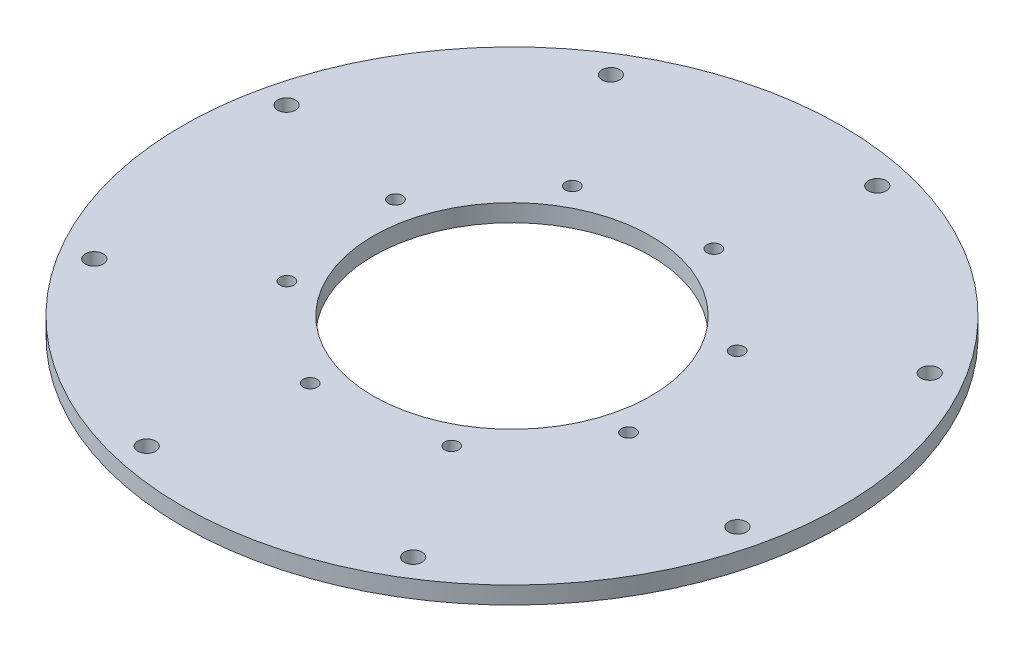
ISO-10303-21;
HEADER;
FILE_DESCRIPTION(('STEP AP214'),'2;1');
FILE_NAME('part.step','',(''),(''),'','','');
FILE_SCHEMA(('AUTOMOTIVE_DESIGN { 1 0 10303 214 1 1 1 1 }'));
ENDSEC;
DATA;
#1=APPLICATION_CONTEXT('core data for automotive mechanical design processes');
#2=APPLICATION_PROTOCOL_DEFINITION('international standard','automotive_design',2000,#1);
#3=PRODUCT_CONTEXT('',#1,'mechanical');
#4=PRODUCT('Part','Part','',(#3));
#5=PRODUCT_RELATED_PRODUCT_CATEGORY('part','',(#4));
#6=PRODUCT_DEFINITION_FORMATION('','',#4);
#7=PRODUCT_DEFINITION_CONTEXT('part definition',#1,'design');
#8=PRODUCT_DEFINITION('design','',#6,#7);
#9=PRODUCT_DEFINITION_SHAPE('','',#8);
#10=(LENGTH_UNIT() NAMED_UNIT(*) SI_UNIT(.MILLI.,.METRE.));
#11=(NAMED_UNIT(*) PLANE_ANGLE_UNIT() SI_UNIT($,.RADIAN.));
#12=(NAMED_UNIT(*) SI_UNIT($,.STERADIAN.) SOLID_ANGLE_UNIT());
#13=UNCERTAINTY_MEASURE_WITH_UNIT(LENGTH_MEASURE(1.E-05),#10,'distance_accuracy_value','');
#14=(GEOMETRIC_REPRESENTATION_CONTEXT(3) GLOBAL_UNCERTAINTY_ASSIGNED_CONTEXT((#13)) GLOBAL_UNIT_ASSIGNED_CONTEXT((#10,
#11,#12)) REPRESENTATION_CONTEXT('',''));
#15=CARTESIAN_POINT('',(0.,0.,0.));
#16=DIRECTION('',(0.,0.,1.));
#17=DIRECTION('',(1.,0.,0.));
#18=AXIS2_PLACEMENT_3D('',#15,#16,#17);
#19=CARTESIAN_POINT('',(0.,6.35,0.));
#20=DIRECTION('',(0.,-1.,0.));
#21=DIRECTION('',(0.,0.,-1.));
#22=AXIS2_PLACEMENT_3D('',#19,#20,#21);
#23=CYLINDRICAL_SURFACE('',#22,120.65);
#24=CARTESIAN_POINT('',(0.,6.35,0.));
#25=DIRECTION('',(0.,1.,0.));
#26=DIRECTION('',(0.,0.,1.));
#27=AXIS2_PLACEMENT_3D('',#24,#25,#26);
#28=CIRCLE('',#27,120.65);
#29=CARTESIAN_POINT('',(0.,6.35,120.65));
#30=VERTEX_POINT('',#29);
#31=EDGE_CURVE('E10',#30,#30,#28,.T.);
#32=ORIENTED_EDGE('',*,*,#31,.F.);
#33=EDGE_LOOP('',(#32));
#34=FACE_BOUND('',#33,.T.);
#35=CARTESIAN_POINT('',(0.,0.,0.));
#36=DIRECTION('',(0.,1.,0.));
#37=DIRECTION('',(0.,0.,1.));
#38=AXIS2_PLACEMENT_3D('',#35,#36,#37);
#39=CIRCLE('',#38,120.65);
#40=CARTESIAN_POINT('',(0.,0.,120.65));
#41=VERTEX_POINT('',#40);
#42=EDGE_CURVE('E43',#41,#41,#39,.T.);
#43=ORIENTED_EDGE('',*,*,#42,.T.);
#44=EDGE_LOOP('',(#43));
#45=FACE_BOUND('',#44,.T.);
#46=ADVANCED_FACE('F36',(#34,#45),#23,.T.);
#47=CARTESIAN_POINT('',(0.,6.35,0.));
#48=DIRECTION('',(0.,1.,0.));
#49=DIRECTION('',(0.,0.,1.));
#50=AXIS2_PLACEMENT_3D('',#47,#48,#49);
#51=PLANE('',#50);
#52=CARTESIAN_POINT('',(-52.2448042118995,6.35,30.159344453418));
#53=DIRECTION('',(0.,1.,0.));
#54=DIRECTION('',(0.,0.,1.));
#55=AXIS2_PLACEMENT_3D('',#52,#53,#54);
#56=CIRCLE('',#55,2.5527);
#57=CARTESIAN_POINT('',(-52.2448042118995,6.35,32.712044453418));
#58=VERTEX_POINT('',#57);
#59=EDGE_CURVE('E218',#58,#58,#56,.T.);
#60=ORIENTED_EDGE('',*,*,#59,.F.);
#61=EDGE_LOOP('',(#60));
#62=FACE_BOUND('',#61,.T.);
#63=CARTESIAN_POINT('',(-58.2685323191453,6.35,-15.6167783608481));
#64=DIRECTION('',(0.,1.,0.));
#65=DIRECTION('',(0.,0.,1.));
#66=AXIS2_PLACEMENT_3D('',#63,#64,#65);
#67=CIRCLE('',#66,2.5527);
#68=CARTESIAN_POINT('',(-58.2685323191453,6.35,-13.0640783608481));
#69=VERTEX_POINT('',#68);
#70=EDGE_CURVE('E228',#69,#69,#67,.T.);
#71=ORIENTED_EDGE('',*,*,#70,.F.);
#72=EDGE_LOOP('',(#71));
#73=FACE_BOUND('',#72,.T.);
#74=CARTESIAN_POINT('',(-30.1593444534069,6.35,-52.2448042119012));
#75=DIRECTION('',(0.,1.,0.));
#76=DIRECTION('',(0.,0.,1.));
#77=AXIS2_PLACEMENT_3D('',#74,#75,#76);
#78=CIRCLE('',#77,2.5527);
#79=CARTESIAN_POINT('',(-30.1593444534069,6.35,-49.6921042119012));
#80=VERTEX_POINT('',#79);
#81=EDGE_CURVE('E39',#80,#80,#78,.T.);
#82=ORIENTED_EDGE('',*,*,#81,.F.);
#83=EDGE_LOOP('',(#82));
#84=FACE_BOUND('',#83,.T.);
#85=CARTESIAN_POINT('',(15.6167783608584,6.35,-58.268532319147));
#86=DIRECTION('',(0.,1.,0.));
#87=DIRECTION('',(0.,0.,1.));
#88=AXIS2_PLACEMENT_3D('',#85,#86,#87);
#89=CIRCLE('',#88,2.5527);
#90=CARTESIAN_POINT('',(15.6167783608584,6.35,-55.715832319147));
#91=VERTEX_POINT('',#90);
#92=EDGE_CURVE('E237',#91,#91,#89,.T.);
#93=ORIENTED_EDGE('',*,*,#92,.F.);
#94=EDGE_LOOP('',(#93));
#95=FACE_BOUND('',#94,.T.);
#96=CARTESIAN_POINT('',(52.2448042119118,6.35,-30.159344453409));
#97=DIRECTION('',(0.,1.,0.));
#98=DIRECTION('',(0.,0.,1.));
#99=AXIS2_PLACEMENT_3D('',#96,#97,#98);
#100=CIRCLE('',#99,2.5527);
#101=CARTESIAN_POINT('',(52.2448042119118,6.35,-27.606644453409));
#102=VERTEX_POINT('',#101);
#103=EDGE_CURVE('E68',#102,#102,#100,.T.);
#104=ORIENTED_EDGE('',*,*,#103,.F.);
#105=EDGE_LOOP('',(#104));
#106=FACE_BOUND('',#105,.T.);
#107=CARTESIAN_POINT('',(58.2685323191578,6.35,15.616778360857));
#108=DIRECTION('',(0.,1.,0.));
#109=DIRECTION('',(0.,0.,1.));
#110=AXIS2_PLACEMENT_3D('',#107,#108,#109);
#111=CIRCLE('',#110,2.5527);
#112=CARTESIAN_POINT('',(58.2685323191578,6.35,18.169478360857));
#113=VERTEX_POINT('',#112);
#114=EDGE_CURVE('E58',#113,#113,#111,.T.);
#115=ORIENTED_EDGE('',*,*,#114,.F.);
#116=EDGE_LOOP('',(#115));
#117=FACE_BOUND('',#116,.T.);
#118=CARTESIAN_POINT('',(30.1593444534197,6.35,52.2448042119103));
#119=DIRECTION('',(0.,1.,0.));
#120=DIRECTION('',(0.,0.,1.));
#121=AXIS2_PLACEMENT_3D('',#118,#119,#120);
#122=CIRCLE('',#121,2.5527);
#123=CARTESIAN_POINT('',(30.1593444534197,6.35,54.7975042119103));
#124=VERTEX_POINT('',#123);
#125=EDGE_CURVE('E65',#124,#124,#122,.T.);
#126=ORIENTED_EDGE('',*,*,#125,.F.);
#127=EDGE_LOOP('',(#126));
#128=FACE_BOUND('',#127,.T.);
#129=CARTESIAN_POINT('',(-15.6167783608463,6.35,58.2685323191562));
#130=DIRECTION('',(0.,1.,0.));
#131=DIRECTION('',(0.,0.,1.));
#132=AXIS2_PLACEMENT_3D('',#129,#130,#131);
#133=CIRCLE('',#132,2.5527);
#134=CARTESIAN_POINT('',(-15.6167783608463,6.35,60.8212323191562));
#135=VERTEX_POINT('',#134);
#136=EDGE_CURVE('E82',#135,#135,#133,.T.);
#137=ORIENTED_EDGE('',*,*,#136,.F.);
#138=EDGE_LOOP('',(#137));
#139=FACE_BOUND('',#138,.T.);
#140=CARTESIAN_POINT('',(25.5902282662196,6.35,-108.138364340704));
#141=DIRECTION('',(0.,1.,0.));
#142=DIRECTION('',(0.,0.,1.));
#143=AXIS2_PLACEMENT_3D('',#140,#141,#142);
#144=CIRCLE('',#143,3.2639);
#145=CARTESIAN_POINT('',(25.5902282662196,6.35,-104.874464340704));
#146=VERTEX_POINT('',#145);
#147=EDGE_CURVE('E57',#146,#146,#144,.T.);
#148=ORIENTED_EDGE('',*,*,#147,.F.);
#149=EDGE_LOOP('',(#148));
#150=FACE_BOUND('',#149,.T.);
#151=CARTESIAN_POINT('',(94.5603948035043,6.35,-58.3703465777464));
#152=DIRECTION('',(0.,1.,0.));
#153=DIRECTION('',(0.,0.,1.));
#154=AXIS2_PLACEMENT_3D('',#151,#152,#153);
#155=CIRCLE('',#154,3.2639);
#156=CARTESIAN_POINT('',(94.5603948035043,6.35,-55.1064465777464));
#157=VERTEX_POINT('',#156);
#158=EDGE_CURVE('E56',#157,#157,#155,.T.);
#159=ORIENTED_EDGE('',*,*,#158,.F.);
#160=EDGE_LOOP('',(#159));
#161=FACE_BOUND('',#160,.T.);
#162=CARTESIAN_POINT('',(-58.3703465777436,6.35,-94.5603948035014));
#163=DIRECTION('',(0.,1.,0.));
#164=DIRECTION('',(0.,0.,1.));
#165=AXIS2_PLACEMENT_3D('',#162,#163,#164);
#166=CIRCLE('',#165,3.2639);
#167=CARTESIAN_POINT('',(-58.3703465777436,6.35,-91.2964948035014));
#168=VERTEX_POINT('',#167);
#169=EDGE_CURVE('E92',#168,#168,#166,.T.);
#170=ORIENTED_EDGE('',*,*,#169,.F.);
#171=EDGE_LOOP('',(#170));
#172=FACE_BOUND('',#171,.T.);
#173=CARTESIAN_POINT('',(108.138364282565,6.35,25.590228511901));
#174=DIRECTION('',(0.,1.,0.));
#175=DIRECTION('',(0.,0.,1.));
#176=AXIS2_PLACEMENT_3D('',#173,#174,#175);
#177=CIRCLE('',#176,3.2639);
#178=CARTESIAN_POINT('',(108.138364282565,6.35,28.854128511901));
#179=VERTEX_POINT('',#178);
#180=EDGE_CURVE('E98',#179,#179,#177,.T.);
#181=ORIENTED_EDGE('',*,*,#180,.F.);
#182=EDGE_LOOP('',(#181));
#183=FACE_BOUND('',#182,.T.);
#184=CARTESIAN_POINT('',(58.3703465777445,6.35,94.5603948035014));
#185=DIRECTION('',(0.,1.,0.));
#186=DIRECTION('',(0.,0.,1.));
#187=AXIS2_PLACEMENT_3D('',#184,#185,#186);
#188=CIRCLE('',#187,3.2639);
#189=CARTESIAN_POINT('',(58.3703465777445,6.35,97.8242948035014));
#190=VERTEX_POINT('',#189);
#191=EDGE_CURVE('E104',#190,#190,#188,.T.);
#192=ORIENTED_EDGE('',*,*,#191,.F.);
#193=EDGE_LOOP('',(#192));
#194=FACE_BOUND('',#193,.T.);
#195=CARTESIAN_POINT('',(-25.5902285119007,6.35,108.138364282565));
#196=DIRECTION('',(0.,1.,0.));
#197=DIRECTION('',(0.,0.,1.));
#198=AXIS2_PLACEMENT_3D('',#195,#196,#197);
#199=CIRCLE('',#198,3.2639);
#200=CARTESIAN_POINT('',(-25.5902285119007,6.35,111.402264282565));
#201=VERTEX_POINT('',#200);
#202=EDGE_CURVE('E110',#201,#201,#199,.T.);
#203=ORIENTED_EDGE('',*,*,#202,.F.);
#204=EDGE_LOOP('',(#203));
#205=FACE_BOUND('',#204,.T.);
#206=CARTESIAN_POINT('',(-94.5603948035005,6.35,58.3703465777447));
#207=DIRECTION('',(0.,1.,0.));
#208=DIRECTION('',(0.,0.,1.));
#209=AXIS2_PLACEMENT_3D('',#206,#207,#208);
#210=CIRCLE('',#209,3.2639);
#211=CARTESIAN_POINT('',(-94.5603948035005,6.35,61.6342465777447));
#212=VERTEX_POINT('',#211);
#213=EDGE_CURVE('E116',#212,#212,#210,.T.);
#214=ORIENTED_EDGE('',*,*,#213,.F.);
#215=EDGE_LOOP('',(#214));
#216=FACE_BOUND('',#215,.T.);
#217=CARTESIAN_POINT('',(-108.138364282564,6.35,-25.590228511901));
#218=DIRECTION('',(0.,1.,0.));
#219=DIRECTION('',(0.,0.,1.));
#220=AXIS2_PLACEMENT_3D('',#217,#218,#219);
#221=CIRCLE('',#220,3.2639);
#222=CARTESIAN_POINT('',(-108.138364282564,6.35,-22.326328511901));
#223=VERTEX_POINT('',#222);
#224=EDGE_CURVE('E122',#223,#223,#221,.T.);
#225=ORIENTED_EDGE('',*,*,#224,.F.);
#226=EDGE_LOOP('',(#225));
#227=FACE_BOUND('',#226,.T.);
#228=CARTESIAN_POINT('',(0.,6.35,0.));
#229=DIRECTION('',(0.,1.,0.));
#230=DIRECTION('',(0.,0.,1.));
#231=AXIS2_PLACEMENT_3D('',#228,#229,#230);
#232=CIRCLE('',#231,50.8);
#233=CARTESIAN_POINT('',(0.,6.35,50.8));
#234=VERTEX_POINT('',#233);
#235=EDGE_CURVE('E51',#234,#234,#232,.T.);
#236=ORIENTED_EDGE('',*,*,#235,.F.);
#237=EDGE_LOOP('',(#236));
#238=FACE_BOUND('',#237,.T.);
#239=ORIENTED_EDGE('',*,*,#31,.T.);
#240=EDGE_LOOP('',(#239));
#241=FACE_BOUND('',#240,.T.);
#242=ADVANCED_FACE('F135',(#62,#73,#84,#95,#106,#117,#128,#139,#150,#161,#172,#183,#194,#205,
#216,#227,#238,#241),#51,.T.);
#243=CARTESIAN_POINT('',(0.,0.,0.));
#244=DIRECTION('',(0.,1.,0.));
#245=DIRECTION('',(0.,0.,1.));
#246=AXIS2_PLACEMENT_3D('',#243,#244,#245);
#247=PLANE('',#246);
#248=CARTESIAN_POINT('',(-52.2448042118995,0.,30.159344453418));
#249=DIRECTION('',(0.,-1.,0.));
#250=DIRECTION('',(0.,0.,-1.));
#251=AXIS2_PLACEMENT_3D('',#248,#249,#250);
#252=CIRCLE('',#251,2.5527);
#253=CARTESIAN_POINT('',(-52.2448042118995,0.,27.606644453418));
#254=VERTEX_POINT('',#253);
#255=EDGE_CURVE('E221',#254,#254,#252,.T.);
#256=ORIENTED_EDGE('',*,*,#255,.F.);
#257=EDGE_LOOP('',(#256));
#258=FACE_BOUND('',#257,.T.);
#259=CARTESIAN_POINT('',(-58.2685323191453,0.,-15.6167783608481));
#260=DIRECTION('',(0.,-1.,0.));
#261=DIRECTION('',(0.,0.,-1.));
#262=AXIS2_PLACEMENT_3D('',#259,#260,#261);
#263=CIRCLE('',#262,2.5527);
#264=CARTESIAN_POINT('',(-58.2685323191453,0.,-18.1694783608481));
#265=VERTEX_POINT('',#264);
#266=EDGE_CURVE('E223',#265,#265,#263,.T.);
#267=ORIENTED_EDGE('',*,*,#266,.F.);
#268=EDGE_LOOP('',(#267));
#269=FACE_BOUND('',#268,.T.);
#270=CARTESIAN_POINT('',(-30.1593444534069,0.,-52.2448042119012));
#271=DIRECTION('',(0.,-1.,0.));
#272=DIRECTION('',(0.,0.,-1.));
#273=AXIS2_PLACEMENT_3D('',#270,#271,#272);
#274=CIRCLE('',#273,2.5527);
#275=CARTESIAN_POINT('',(-30.1593444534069,0.,-54.7975042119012));
#276=VERTEX_POINT('',#275);
#277=EDGE_CURVE('E231',#276,#276,#274,.T.);
#278=ORIENTED_EDGE('',*,*,#277,.F.);
#279=EDGE_LOOP('',(#278));
#280=FACE_BOUND('',#279,.T.);
#281=CARTESIAN_POINT('',(15.6167783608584,0.,-58.268532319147));
#282=DIRECTION('',(0.,-1.,0.));
#283=DIRECTION('',(0.,0.,-1.));
#284=AXIS2_PLACEMENT_3D('',#281,#282,#283);
#285=CIRCLE('',#284,2.5527);
#286=CARTESIAN_POINT('',(15.6167783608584,0.,-60.821232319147));
#287=VERTEX_POINT('',#286);
#288=EDGE_CURVE('E234',#287,#287,#285,.T.);
#289=ORIENTED_EDGE('',*,*,#288,.F.);
#290=EDGE_LOOP('',(#289));
#291=FACE_BOUND('',#290,.T.);
#292=CARTESIAN_POINT('',(52.2448042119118,0.,-30.159344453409));
#293=DIRECTION('',(0.,-1.,0.));
#294=DIRECTION('',(0.,0.,-1.));
#295=AXIS2_PLACEMENT_3D('',#292,#293,#294);
#296=CIRCLE('',#295,2.5527);
#297=CARTESIAN_POINT('',(52.2448042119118,0.,-32.712044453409));
#298=VERTEX_POINT('',#297);
#299=EDGE_CURVE('E73',#298,#298,#296,.T.);
#300=ORIENTED_EDGE('',*,*,#299,.F.);
#301=EDGE_LOOP('',(#300));
#302=FACE_BOUND('',#301,.T.);
#303=CARTESIAN_POINT('',(58.2685323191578,0.,15.616778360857));
#304=DIRECTION('',(0.,-1.,0.));
#305=DIRECTION('',(0.,0.,-1.));
#306=AXIS2_PLACEMENT_3D('',#303,#304,#305);
#307=CIRCLE('',#306,2.5527);
#308=CARTESIAN_POINT('',(58.2685323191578,0.,13.064078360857));
#309=VERTEX_POINT('',#308);
#310=EDGE_CURVE('E61',#309,#309,#307,.T.);
#311=ORIENTED_EDGE('',*,*,#310,.F.);
#312=EDGE_LOOP('',(#311));
#313=FACE_BOUND('',#312,.T.);
#314=CARTESIAN_POINT('',(30.1593444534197,0.,52.2448042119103));
#315=DIRECTION('',(0.,-1.,0.));
#316=DIRECTION('',(0.,0.,-1.));
#317=AXIS2_PLACEMENT_3D('',#314,#315,#316);
#318=CIRCLE('',#317,2.5527);
#319=CARTESIAN_POINT('',(30.1593444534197,0.,49.6921042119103));
#320=VERTEX_POINT('',#319);
#321=EDGE_CURVE('E60',#320,#320,#318,.T.);
#322=ORIENTED_EDGE('',*,*,#321,.F.);
#323=EDGE_LOOP('',(#322));
#324=FACE_BOUND('',#323,.T.);
#325=CARTESIAN_POINT('',(-15.6167783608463,0.,58.2685323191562));
#326=DIRECTION('',(0.,-1.,0.));
#327=DIRECTION('',(0.,0.,-1.));
#328=AXIS2_PLACEMENT_3D('',#325,#326,#327);
#329=CIRCLE('',#328,2.5527);
#330=CARTESIAN_POINT('',(-15.6167783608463,0.,55.7158323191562));
#331=VERTEX_POINT('',#330);
#332=EDGE_CURVE('E79',#331,#331,#329,.T.);
#333=ORIENTED_EDGE('',*,*,#332,.F.);
#334=EDGE_LOOP('',(#333));
#335=FACE_BOUND('',#334,.T.);
#336=CARTESIAN_POINT('',(25.5902282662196,0.,-108.138364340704));
#337=DIRECTION('',(0.,1.,0.));
#338=DIRECTION('',(0.,0.,1.));
#339=AXIS2_PLACEMENT_3D('',#336,#337,#338);
#340=CIRCLE('',#339,3.2639);
#341=CARTESIAN_POINT('',(25.5902282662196,0.,-104.874464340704));
#342=VERTEX_POINT('',#341);
#343=EDGE_CURVE('E54',#342,#342,#340,.T.);
#344=ORIENTED_EDGE('',*,*,#343,.T.);
#345=EDGE_LOOP('',(#344));
#346=FACE_BOUND('',#345,.T.);
#347=CARTESIAN_POINT('',(94.5603948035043,0.,-58.3703465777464));
#348=DIRECTION('',(0.,1.,0.));
#349=DIRECTION('',(0.,0.,1.));
#350=AXIS2_PLACEMENT_3D('',#347,#348,#349);
#351=CIRCLE('',#350,3.2639);
#352=CARTESIAN_POINT('',(94.5603948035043,0.,-55.1064465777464));
#353=VERTEX_POINT('',#352);
#354=EDGE_CURVE('E89',#353,#353,#351,.T.);
#355=ORIENTED_EDGE('',*,*,#354,.T.);
#356=EDGE_LOOP('',(#355));
#357=FACE_BOUND('',#356,.T.);
#358=CARTESIAN_POINT('',(-58.3703465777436,0.,-94.5603948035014));
#359=DIRECTION('',(0.,1.,0.));
#360=DIRECTION('',(0.,0.,1.));
#361=AXIS2_PLACEMENT_3D('',#358,#359,#360);
#362=CIRCLE('',#361,3.2639);
#363=CARTESIAN_POINT('',(-58.3703465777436,0.,-91.2964948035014));
#364=VERTEX_POINT('',#363);
#365=EDGE_CURVE('E95',#364,#364,#362,.T.);
#366=ORIENTED_EDGE('',*,*,#365,.T.);
#367=EDGE_LOOP('',(#366));
#368=FACE_BOUND('',#367,.T.);
#369=CARTESIAN_POINT('',(108.138364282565,0.,25.590228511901));
#370=DIRECTION('',(0.,1.,0.));
#371=DIRECTION('',(0.,0.,1.));
#372=AXIS2_PLACEMENT_3D('',#369,#370,#371);
#373=CIRCLE('',#372,3.2639);
#374=CARTESIAN_POINT('',(108.138364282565,0.,28.854128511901));
#375=VERTEX_POINT('',#374);
#376=EDGE_CURVE('E101',#375,#375,#373,.T.);
#377=ORIENTED_EDGE('',*,*,#376,.T.);
#378=EDGE_LOOP('',(#377));
#379=FACE_BOUND('',#378,.T.);
#380=CARTESIAN_POINT('',(58.3703465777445,0.,94.5603948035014));
#381=DIRECTION('',(0.,1.,0.));
#382=DIRECTION('',(0.,0.,1.));
#383=AXIS2_PLACEMENT_3D('',#380,#381,#382);
#384=CIRCLE('',#383,3.2639);
#385=CARTESIAN_POINT('',(58.3703465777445,0.,97.8242948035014));
#386=VERTEX_POINT('',#385);
#387=EDGE_CURVE('E107',#386,#386,#384,.T.);
#388=ORIENTED_EDGE('',*,*,#387,.T.);
#389=EDGE_LOOP('',(#388));
#390=FACE_BOUND('',#389,.T.);
#391=CARTESIAN_POINT('',(-25.5902285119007,0.,108.138364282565));
#392=DIRECTION('',(0.,1.,0.));
#393=DIRECTION('',(0.,0.,1.));
#394=AXIS2_PLACEMENT_3D('',#391,#392,#393);
#395=CIRCLE('',#394,3.2639);
#396=CARTESIAN_POINT('',(-25.5902285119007,0.,111.402264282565));
#397=VERTEX_POINT('',#396);
#398=EDGE_CURVE('E113',#397,#397,#395,.T.);
#399=ORIENTED_EDGE('',*,*,#398,.T.);
#400=EDGE_LOOP('',(#399));
#401=FACE_BOUND('',#400,.T.);
#402=CARTESIAN_POINT('',(-94.5603948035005,0.,58.3703465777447));
#403=DIRECTION('',(0.,1.,0.));
#404=DIRECTION('',(0.,0.,1.));
#405=AXIS2_PLACEMENT_3D('',#402,#403,#404);
#406=CIRCLE('',#405,3.2639);
#407=CARTESIAN_POINT('',(-94.5603948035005,0.,61.6342465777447));
#408=VERTEX_POINT('',#407);
#409=EDGE_CURVE('E119',#408,#408,#406,.T.);
#410=ORIENTED_EDGE('',*,*,#409,.T.);
#411=EDGE_LOOP('',(#410));
#412=FACE_BOUND('',#411,.T.);
#413=CARTESIAN_POINT('',(-108.138364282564,0.,-25.590228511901));
#414=DIRECTION('',(0.,1.,0.));
#415=DIRECTION('',(0.,0.,1.));
#416=AXIS2_PLACEMENT_3D('',#413,#414,#415);
#417=CIRCLE('',#416,3.2639);
#418=CARTESIAN_POINT('',(-108.138364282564,0.,-22.326328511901));
#419=VERTEX_POINT('',#418);
#420=EDGE_CURVE('E125',#419,#419,#417,.T.);
#421=ORIENTED_EDGE('',*,*,#420,.T.);
#422=EDGE_LOOP('',(#421));
#423=FACE_BOUND('',#422,.T.);
#424=CARTESIAN_POINT('',(0.,0.,0.));
#425=DIRECTION('',(0.,1.,0.));
#426=DIRECTION('',(0.,0.,1.));
#427=AXIS2_PLACEMENT_3D('',#424,#425,#426);
#428=CIRCLE('',#427,50.8);
#429=CARTESIAN_POINT('',(0.,0.,50.8));
#430=VERTEX_POINT('',#429);
#431=EDGE_CURVE('E48',#430,#430,#428,.T.);
#432=ORIENTED_EDGE('',*,*,#431,.T.);
#433=EDGE_LOOP('',(#432));
#434=FACE_BOUND('',#433,.T.);
#435=ORIENTED_EDGE('',*,*,#42,.F.);
#436=EDGE_LOOP('',(#435));
#437=FACE_BOUND('',#436,.T.);
#438=ADVANCED_FACE('F137',(#258,#269,#280,#291,#302,#313,#324,#335,#346,#357,#368,#379,#390,
#401,#412,#423,#434,#437),#247,.F.);
#439=CARTESIAN_POINT('',(0.,0.,0.));
#440=DIRECTION('',(0.,1.,0.));
#441=DIRECTION('',(0.,0.,1.));
#442=AXIS2_PLACEMENT_3D('',#439,#440,#441);
#443=CYLINDRICAL_SURFACE('',#442,50.8);
#444=ORIENTED_EDGE('',*,*,#431,.F.);
#445=EDGE_LOOP('',(#444));
#446=FACE_BOUND('',#445,.T.);
#447=ORIENTED_EDGE('',*,*,#235,.T.);
#448=EDGE_LOOP('',(#447));
#449=FACE_BOUND('',#448,.T.);
#450=ADVANCED_FACE('F133',(#446,#449),#443,.F.);
#451=CARTESIAN_POINT('',(-108.138364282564,6.35,-25.590228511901));
#452=DIRECTION('',(0.,1.,0.));
#453=DIRECTION('',(0.,0.,1.));
#454=AXIS2_PLACEMENT_3D('',#451,#452,#453);
#455=CYLINDRICAL_SURFACE('',#454,3.2639);
#456=ORIENTED_EDGE('',*,*,#224,.T.);
#457=EDGE_LOOP('',(#456));
#458=FACE_BOUND('',#457,.T.);
#459=ORIENTED_EDGE('',*,*,#420,.F.);
#460=EDGE_LOOP('',(#459));
#461=FACE_BOUND('',#460,.T.);
#462=ADVANCED_FACE('F151',(#458,#461),#455,.F.);
#463=CARTESIAN_POINT('',(-94.5603948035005,6.35,58.3703465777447));
#464=DIRECTION('',(0.,1.,0.));
#465=DIRECTION('',(0.,0.,1.));
#466=AXIS2_PLACEMENT_3D('',#463,#464,#465);
#467=CYLINDRICAL_SURFACE('',#466,3.2639);
#468=ORIENTED_EDGE('',*,*,#213,.T.);
#469=EDGE_LOOP('',(#468));
#470=FACE_BOUND('',#469,.T.);
#471=ORIENTED_EDGE('',*,*,#409,.F.);
#472=EDGE_LOOP('',(#471));
#473=FACE_BOUND('',#472,.T.);
#474=ADVANCED_FACE('F155',(#470,#473),#467,.F.);
#475=CARTESIAN_POINT('',(-25.5902285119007,6.35,108.138364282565));
#476=DIRECTION('',(0.,1.,0.));
#477=DIRECTION('',(0.,0.,1.));
#478=AXIS2_PLACEMENT_3D('',#475,#476,#477);
#479=CYLINDRICAL_SURFACE('',#478,3.2639);
#480=ORIENTED_EDGE('',*,*,#202,.T.);
#481=EDGE_LOOP('',(#480));
#482=FACE_BOUND('',#481,.T.);
#483=ORIENTED_EDGE('',*,*,#398,.F.);
#484=EDGE_LOOP('',(#483));
#485=FACE_BOUND('',#484,.T.);
#486=ADVANCED_FACE('F159',(#482,#485),#479,.F.);
#487=CARTESIAN_POINT('',(58.3703465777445,6.35,94.5603948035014));
#488=DIRECTION('',(0.,1.,0.));
#489=DIRECTION('',(0.,0.,1.));
#490=AXIS2_PLACEMENT_3D('',#487,#488,#489);
#491=CYLINDRICAL_SURFACE('',#490,3.2639);
#492=ORIENTED_EDGE('',*,*,#191,.T.);
#493=EDGE_LOOP('',(#492));
#494=FACE_BOUND('',#493,.T.);
#495=ORIENTED_EDGE('',*,*,#387,.F.);
#496=EDGE_LOOP('',(#495));
#497=FACE_BOUND('',#496,.T.);
#498=ADVANCED_FACE('F163',(#494,#497),#491,.F.);
#499=CARTESIAN_POINT('',(108.138364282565,6.35,25.590228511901));
#500=DIRECTION('',(0.,1.,0.));
#501=DIRECTION('',(0.,0.,1.));
#502=AXIS2_PLACEMENT_3D('',#499,#500,#501);
#503=CYLINDRICAL_SURFACE('',#502,3.2639);
#504=ORIENTED_EDGE('',*,*,#180,.T.);
#505=EDGE_LOOP('',(#504));
#506=FACE_BOUND('',#505,.T.);
#507=ORIENTED_EDGE('',*,*,#376,.F.);
#508=EDGE_LOOP('',(#507));
#509=FACE_BOUND('',#508,.T.);
#510=ADVANCED_FACE('F167',(#506,#509),#503,.F.);
#511=CARTESIAN_POINT('',(-58.3703465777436,6.35,-94.5603948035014));
#512=DIRECTION('',(0.,1.,0.));
#513=DIRECTION('',(0.,0.,1.));
#514=AXIS2_PLACEMENT_3D('',#511,#512,#513);
#515=CYLINDRICAL_SURFACE('',#514,3.2639);
#516=ORIENTED_EDGE('',*,*,#169,.T.);
#517=EDGE_LOOP('',(#516));
#518=FACE_BOUND('',#517,.T.);
#519=ORIENTED_EDGE('',*,*,#365,.F.);
#520=EDGE_LOOP('',(#519));
#521=FACE_BOUND('',#520,.T.);
#522=ADVANCED_FACE('F171',(#518,#521),#515,.F.);
#523=CARTESIAN_POINT('',(94.5603948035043,6.35,-58.3703465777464));
#524=DIRECTION('',(0.,1.,0.));
#525=DIRECTION('',(0.,0.,1.));
#526=AXIS2_PLACEMENT_3D('',#523,#524,#525);
#527=CYLINDRICAL_SURFACE('',#526,3.2639);
#528=ORIENTED_EDGE('',*,*,#158,.T.);
#529=EDGE_LOOP('',(#528));
#530=FACE_BOUND('',#529,.T.);
#531=ORIENTED_EDGE('',*,*,#354,.F.);
#532=EDGE_LOOP('',(#531));
#533=FACE_BOUND('',#532,.T.);
#534=ADVANCED_FACE('F175',(#530,#533),#527,.F.);
#535=CARTESIAN_POINT('',(25.5902282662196,6.35,-108.138364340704));
#536=DIRECTION('',(0.,1.,0.));
#537=DIRECTION('',(0.,0.,1.));
#538=AXIS2_PLACEMENT_3D('',#535,#536,#537);
#539=CYLINDRICAL_SURFACE('',#538,3.2639);
#540=ORIENTED_EDGE('',*,*,#147,.T.);
#541=EDGE_LOOP('',(#540));
#542=FACE_BOUND('',#541,.T.);
#543=ORIENTED_EDGE('',*,*,#343,.F.);
#544=EDGE_LOOP('',(#543));
#545=FACE_BOUND('',#544,.T.);
#546=ADVANCED_FACE('F179',(#542,#545),#539,.F.);
#547=CARTESIAN_POINT('',(-15.6167783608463,0.,58.2685323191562));
#548=DIRECTION('',(0.,-1.,0.));
#549=DIRECTION('',(0.,0.,-1.));
#550=AXIS2_PLACEMENT_3D('',#547,#548,#549);
#551=CYLINDRICAL_SURFACE('',#550,2.5527);
#552=ORIENTED_EDGE('',*,*,#136,.T.);
#553=EDGE_LOOP('',(#552));
#554=FACE_BOUND('',#553,.T.);
#555=ORIENTED_EDGE('',*,*,#332,.T.);
#556=EDGE_LOOP('',(#555));
#557=FACE_BOUND('',#556,.T.);
#558=ADVANCED_FACE('F183',(#554,#557),#551,.F.);
#559=CARTESIAN_POINT('',(30.1593444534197,0.,52.2448042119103));
#560=DIRECTION('',(0.,-1.,0.));
#561=DIRECTION('',(0.,0.,-1.));
#562=AXIS2_PLACEMENT_3D('',#559,#560,#561);
#563=CYLINDRICAL_SURFACE('',#562,2.5527);
#564=ORIENTED_EDGE('',*,*,#125,.T.);
#565=EDGE_LOOP('',(#564));
#566=FACE_BOUND('',#565,.T.);
#567=ORIENTED_EDGE('',*,*,#321,.T.);
#568=EDGE_LOOP('',(#567));
#569=FACE_BOUND('',#568,.T.);
#570=ADVANCED_FACE('F187',(#566,#569),#563,.F.);
#571=CARTESIAN_POINT('',(58.2685323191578,0.,15.616778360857));
#572=DIRECTION('',(0.,-1.,0.));
#573=DIRECTION('',(0.,0.,-1.));
#574=AXIS2_PLACEMENT_3D('',#571,#572,#573);
#575=CYLINDRICAL_SURFACE('',#574,2.5527);
#576=ORIENTED_EDGE('',*,*,#114,.T.);
#577=EDGE_LOOP('',(#576));
#578=FACE_BOUND('',#577,.T.);
#579=ORIENTED_EDGE('',*,*,#310,.T.);
#580=EDGE_LOOP('',(#579));
#581=FACE_BOUND('',#580,.T.);
#582=ADVANCED_FACE('F191',(#578,#581),#575,.F.);
#583=CARTESIAN_POINT('',(52.2448042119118,0.,-30.159344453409));
#584=DIRECTION('',(0.,-1.,0.));
#585=DIRECTION('',(0.,0.,-1.));
#586=AXIS2_PLACEMENT_3D('',#583,#584,#585);
#587=CYLINDRICAL_SURFACE('',#586,2.5527);
#588=ORIENTED_EDGE('',*,*,#103,.T.);
#589=EDGE_LOOP('',(#588));
#590=FACE_BOUND('',#589,.T.);
#591=ORIENTED_EDGE('',*,*,#299,.T.);
#592=EDGE_LOOP('',(#591));
#593=FACE_BOUND('',#592,.T.);
#594=ADVANCED_FACE('F195',(#590,#593),#587,.F.);
#595=CARTESIAN_POINT('',(15.6167783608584,0.,-58.268532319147));
#596=DIRECTION('',(0.,-1.,0.));
#597=DIRECTION('',(0.,0.,-1.));
#598=AXIS2_PLACEMENT_3D('',#595,#596,#597);
#599=CYLINDRICAL_SURFACE('',#598,2.5527);
#600=ORIENTED_EDGE('',*,*,#92,.T.);
#601=EDGE_LOOP('',(#600));
#602=FACE_BOUND('',#601,.T.);
#603=ORIENTED_EDGE('',*,*,#288,.T.);
#604=EDGE_LOOP('',(#603));
#605=FACE_BOUND('',#604,.T.);
#606=ADVANCED_FACE('F198',(#602,#605),#599,.F.);
#607=CARTESIAN_POINT('',(-30.1593444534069,0.,-52.2448042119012));
#608=DIRECTION('',(0.,-1.,0.));
#609=DIRECTION('',(0.,0.,-1.));
#610=AXIS2_PLACEMENT_3D('',#607,#608,#609);
#611=CYLINDRICAL_SURFACE('',#610,2.5527);
#612=ORIENTED_EDGE('',*,*,#81,.T.);
#613=EDGE_LOOP('',(#612));
#614=FACE_BOUND('',#613,.T.);
#615=ORIENTED_EDGE('',*,*,#277,.T.);
#616=EDGE_LOOP('',(#615));
#617=FACE_BOUND('',#616,.T.);
#618=ADVANCED_FACE('F202',(#614,#617),#611,.F.);
#619=CARTESIAN_POINT('',(-58.2685323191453,0.,-15.6167783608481));
#620=DIRECTION('',(0.,-1.,0.));
#621=DIRECTION('',(0.,0.,-1.));
#622=AXIS2_PLACEMENT_3D('',#619,#620,#621);
#623=CYLINDRICAL_SURFACE('',#622,2.5527);
#624=ORIENTED_EDGE('',*,*,#70,.T.);
#625=EDGE_LOOP('',(#624));
#626=FACE_BOUND('',#625,.T.);
#627=ORIENTED_EDGE('',*,*,#266,.T.);
#628=EDGE_LOOP('',(#627));
#629=FACE_BOUND('',#628,.T.);
#630=ADVANCED_FACE('F206',(#626,#629),#623,.F.);
#631=CARTESIAN_POINT('',(-52.2448042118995,0.,30.159344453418));
#632=DIRECTION('',(0.,-1.,0.));
#633=DIRECTION('',(0.,0.,-1.));
#634=AXIS2_PLACEMENT_3D('',#631,#632,#633);
#635=CYLINDRICAL_SURFACE('',#634,2.5527);
#636=ORIENTED_EDGE('',*,*,#59,.T.);
#637=EDGE_LOOP('',(#636));
#638=FACE_BOUND('',#637,.T.);
#639=ORIENTED_EDGE('',*,*,#255,.T.);
#640=EDGE_LOOP('',(#639));
#641=FACE_BOUND('',#640,.T.);
#642=ADVANCED_FACE('F210',(#638,#641),#635,.F.);
#643=CLOSED_SHELL('',(#46,#242,#438,#450,#462,#474,#486,#498,#510,#522,#534,#546,#558,#570,#582,
#594,#606,#618,#630,#642));
#644=MANIFOLD_SOLID_BREP('B2',#643);
#645=ADVANCED_BREP_SHAPE_REPRESENTATION('',(#18,#644),#14);
#646=SHAPE_DEFINITION_REPRESENTATION(#9,#645);
ENDSEC;
END-ISO-10303-21;
